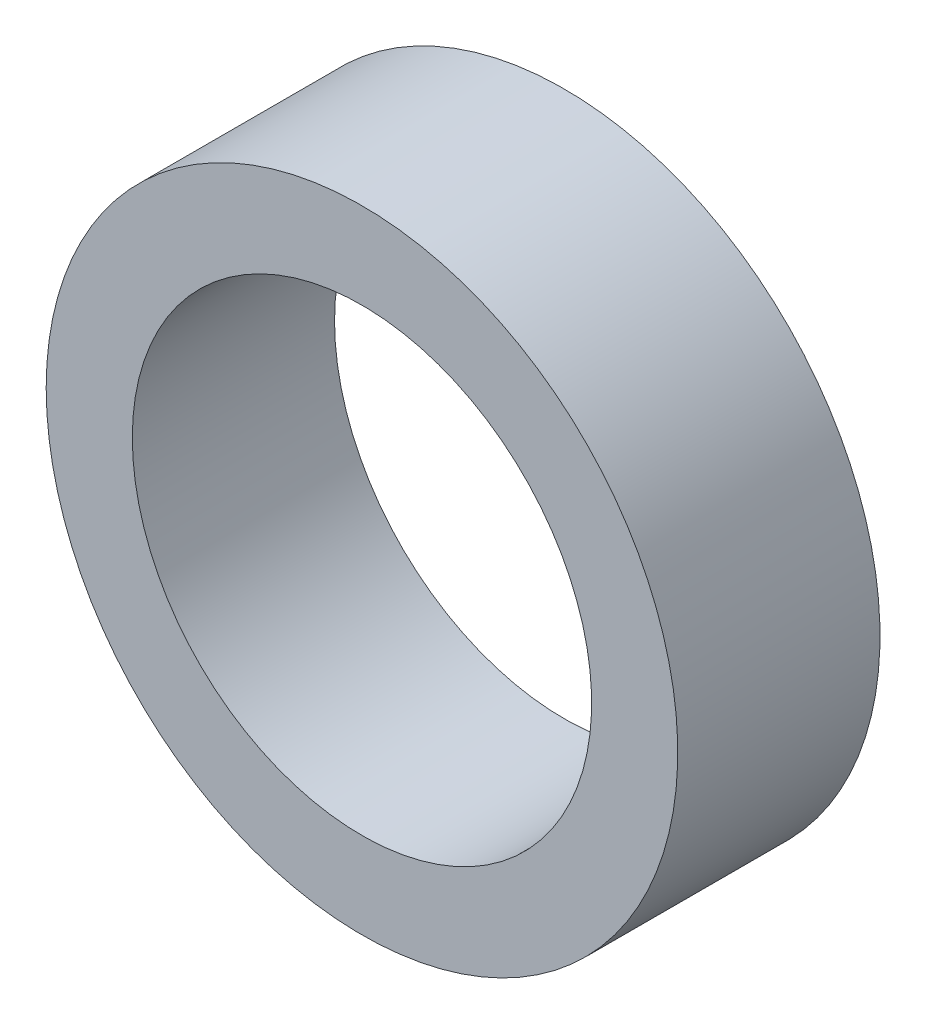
ISO-10303-21;
HEADER;
FILE_DESCRIPTION(('STEP AP214'),'2;1');
FILE_NAME('part.step','',(''),(''),'','','');
FILE_SCHEMA(('AUTOMOTIVE_DESIGN { 1 0 10303 214 1 1 1 1 }'));
ENDSEC;
DATA;
#1=APPLICATION_CONTEXT('core data for automotive mechanical design processes');
#2=APPLICATION_PROTOCOL_DEFINITION('international standard','automotive_design',2000,#1);
#3=PRODUCT_CONTEXT('',#1,'mechanical');
#4=PRODUCT('Part','Part','',(#3));
#5=PRODUCT_RELATED_PRODUCT_CATEGORY('part','',(#4));
#6=PRODUCT_DEFINITION_FORMATION('','',#4);
#7=PRODUCT_DEFINITION_CONTEXT('part definition',#1,'design');
#8=PRODUCT_DEFINITION('design','',#6,#7);
#9=PRODUCT_DEFINITION_SHAPE('','',#8);
#10=(LENGTH_UNIT() NAMED_UNIT(*) SI_UNIT(.MILLI.,.METRE.));
#11=(NAMED_UNIT(*) PLANE_ANGLE_UNIT() SI_UNIT($,.RADIAN.));
#12=(NAMED_UNIT(*) SI_UNIT($,.STERADIAN.) SOLID_ANGLE_UNIT());
#13=UNCERTAINTY_MEASURE_WITH_UNIT(LENGTH_MEASURE(1.E-05),#10,'distance_accuracy_value','');
#14=(GEOMETRIC_REPRESENTATION_CONTEXT(3) GLOBAL_UNCERTAINTY_ASSIGNED_CONTEXT((#13)) GLOBAL_UNIT_ASSIGNED_CONTEXT((#10,
#11,#12)) REPRESENTATION_CONTEXT('',''));
#15=CARTESIAN_POINT('',(0.,0.,0.));
#16=DIRECTION('',(0.,0.,1.));
#17=DIRECTION('',(1.,0.,0.));
#18=AXIS2_PLACEMENT_3D('',#15,#16,#17);
#19=CARTESIAN_POINT('',(0.,0.,6.604));
#20=DIRECTION('',(0.,0.,1.));
#21=DIRECTION('',(1.,0.,0.));
#22=AXIS2_PLACEMENT_3D('',#19,#20,#21);
#23=PLANE('',#22);
#24=CARTESIAN_POINT('',(0.,0.,6.604));
#25=DIRECTION('',(0.,0.,1.));
#26=DIRECTION('',(1.,0.,0.));
#27=AXIS2_PLACEMENT_3D('',#24,#25,#26);
#28=CIRCLE('',#27,10.3124);
#29=CARTESIAN_POINT('',(-10.3124,0.,6.604));
#30=VERTEX_POINT('',#29);
#31=EDGE_CURVE('E10',#30,#30,#28,.T.);
#32=ORIENTED_EDGE('',*,*,#31,.T.);
#33=EDGE_LOOP('',(#32));
#34=FACE_BOUND('',#33,.T.);
#35=CARTESIAN_POINT('',(0.,0.,6.604));
#36=DIRECTION('',(0.,0.,1.));
#37=DIRECTION('',(1.,0.,0.));
#38=AXIS2_PLACEMENT_3D('',#35,#36,#37);
#39=CIRCLE('',#38,7.5);
#40=CARTESIAN_POINT('',(-7.5,0.,6.604));
#41=VERTEX_POINT('',#40);
#42=EDGE_CURVE('E42',#41,#41,#39,.T.);
#43=ORIENTED_EDGE('',*,*,#42,.F.);
#44=EDGE_LOOP('',(#43));
#45=FACE_BOUND('',#44,.T.);
#46=ADVANCED_FACE('F31',(#34,#45),#23,.T.);
#47=CARTESIAN_POINT('',(0.,0.,0.));
#48=DIRECTION('',(0.,0.,1.));
#49=DIRECTION('',(1.,0.,0.));
#50=AXIS2_PLACEMENT_3D('',#47,#48,#49);
#51=PLANE('',#50);
#52=CARTESIAN_POINT('',(0.,0.,0.));
#53=DIRECTION('',(0.,0.,1.));
#54=DIRECTION('',(1.,0.,0.));
#55=AXIS2_PLACEMENT_3D('',#52,#53,#54);
#56=CIRCLE('',#55,10.3124);
#57=CARTESIAN_POINT('',(-10.3124,0.,0.));
#58=VERTEX_POINT('',#57);
#59=EDGE_CURVE('E35',#58,#58,#56,.T.);
#60=ORIENTED_EDGE('',*,*,#59,.F.);
#61=EDGE_LOOP('',(#60));
#62=FACE_BOUND('',#61,.T.);
#63=CARTESIAN_POINT('',(0.,0.,0.));
#64=DIRECTION('',(0.,0.,1.));
#65=DIRECTION('',(1.,0.,0.));
#66=AXIS2_PLACEMENT_3D('',#63,#64,#65);
#67=CIRCLE('',#66,7.5);
#68=CARTESIAN_POINT('',(-7.5,0.,0.));
#69=VERTEX_POINT('',#68);
#70=EDGE_CURVE('E44',#69,#69,#67,.T.);
#71=ORIENTED_EDGE('',*,*,#70,.T.);
#72=EDGE_LOOP('',(#71));
#73=FACE_BOUND('',#72,.T.);
#74=ADVANCED_FACE('F54',(#62,#73),#51,.F.);
#75=CARTESIAN_POINT('',(0.,0.,6.604));
#76=DIRECTION('',(0.,0.,-1.));
#77=DIRECTION('',(-1.,0.,0.));
#78=AXIS2_PLACEMENT_3D('',#75,#76,#77);
#79=CYLINDRICAL_SURFACE('',#78,10.3124);
#80=CARTESIAN_POINT('',(-10.3124,0.,6.604));
#81=CARTESIAN_POINT('',(-10.3124,0.,6.53520833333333));
#82=CARTESIAN_POINT('',(-10.3124,0.,6.46641666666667));
#83=CARTESIAN_POINT('',(-10.3124,0.,6.32883333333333));
#84=CARTESIAN_POINT('',(-10.3124,0.,6.26004166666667));
#85=CARTESIAN_POINT('',(-10.3124,0.,6.12245833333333));
#86=CARTESIAN_POINT('',(-10.3124,0.,6.05366666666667));
#87=CARTESIAN_POINT('',(-10.3124,0.,5.91608333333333));
#88=CARTESIAN_POINT('',(-10.3124,0.,5.84729166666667));
#89=CARTESIAN_POINT('',(-10.3124,0.,5.70970833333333));
#90=CARTESIAN_POINT('',(-10.3124,0.,5.64091666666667));
#91=CARTESIAN_POINT('',(-10.3124,0.,5.50333333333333));
#92=CARTESIAN_POINT('',(-10.3124,0.,5.43454166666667));
#93=CARTESIAN_POINT('',(-10.3124,0.,5.29695833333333));
#94=CARTESIAN_POINT('',(-10.3124,0.,5.22816666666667));
#95=CARTESIAN_POINT('',(-10.3124,0.,5.09058333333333));
#96=CARTESIAN_POINT('',(-10.3124,0.,5.02179166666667));
#97=CARTESIAN_POINT('',(-10.3124,0.,4.88420833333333));
#98=CARTESIAN_POINT('',(-10.3124,0.,4.81541666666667));
#99=CARTESIAN_POINT('',(-10.3124,0.,4.67783333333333));
#100=CARTESIAN_POINT('',(-10.3124,0.,4.60904166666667));
#101=CARTESIAN_POINT('',(-10.3124,0.,4.47145833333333));
#102=CARTESIAN_POINT('',(-10.3124,0.,4.40266666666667));
#103=CARTESIAN_POINT('',(-10.3124,0.,4.26508333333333));
#104=CARTESIAN_POINT('',(-10.3124,0.,4.19629166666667));
#105=CARTESIAN_POINT('',(-10.3124,0.,4.05870833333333));
#106=CARTESIAN_POINT('',(-10.3124,0.,3.98991666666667));
#107=CARTESIAN_POINT('',(-10.3124,0.,3.85233333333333));
#108=CARTESIAN_POINT('',(-10.3124,0.,3.78354166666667));
#109=CARTESIAN_POINT('',(-10.3124,0.,3.64595833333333));
#110=CARTESIAN_POINT('',(-10.3124,0.,3.57716666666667));
#111=CARTESIAN_POINT('',(-10.3124,0.,3.43958333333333));
#112=CARTESIAN_POINT('',(-10.3124,0.,3.37079166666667));
#113=CARTESIAN_POINT('',(-10.3124,0.,3.23320833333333));
#114=CARTESIAN_POINT('',(-10.3124,0.,3.16441666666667));
#115=CARTESIAN_POINT('',(-10.3124,0.,3.02683333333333));
#116=CARTESIAN_POINT('',(-10.3124,0.,2.95804166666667));
#117=CARTESIAN_POINT('',(-10.3124,0.,2.82045833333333));
#118=CARTESIAN_POINT('',(-10.3124,0.,2.75166666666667));
#119=CARTESIAN_POINT('',(-10.3124,0.,2.61408333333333));
#120=CARTESIAN_POINT('',(-10.3124,0.,2.54529166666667));
#121=CARTESIAN_POINT('',(-10.3124,0.,2.40770833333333));
#122=CARTESIAN_POINT('',(-10.3124,0.,2.33891666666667));
#123=CARTESIAN_POINT('',(-10.3124,0.,2.20133333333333));
#124=CARTESIAN_POINT('',(-10.3124,0.,2.13254166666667));
#125=CARTESIAN_POINT('',(-10.3124,0.,1.99495833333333));
#126=CARTESIAN_POINT('',(-10.3124,0.,1.92616666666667));
#127=CARTESIAN_POINT('',(-10.3124,0.,1.78858333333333));
#128=CARTESIAN_POINT('',(-10.3124,0.,1.71979166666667));
#129=CARTESIAN_POINT('',(-10.3124,0.,1.58220833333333));
#130=CARTESIAN_POINT('',(-10.3124,0.,1.51341666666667));
#131=CARTESIAN_POINT('',(-10.3124,0.,1.37583333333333));
#132=CARTESIAN_POINT('',(-10.3124,0.,1.30704166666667));
#133=CARTESIAN_POINT('',(-10.3124,0.,1.16945833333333));
#134=CARTESIAN_POINT('',(-10.3124,0.,1.10066666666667));
#135=CARTESIAN_POINT('',(-10.3124,0.,0.963083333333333));
#136=CARTESIAN_POINT('',(-10.3124,0.,0.894291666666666));
#137=CARTESIAN_POINT('',(-10.3124,0.,0.756708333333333));
#138=CARTESIAN_POINT('',(-10.3124,0.,0.687916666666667));
#139=CARTESIAN_POINT('',(-10.3124,0.,0.550333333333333));
#140=CARTESIAN_POINT('',(-10.3124,0.,0.481541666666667));
#141=CARTESIAN_POINT('',(-10.3124,0.,0.343958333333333));
#142=CARTESIAN_POINT('',(-10.3124,0.,0.275166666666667));
#143=CARTESIAN_POINT('',(-10.3124,0.,0.137583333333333));
#144=CARTESIAN_POINT('',(-10.3124,0.,0.0687916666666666));
#145=CARTESIAN_POINT('',(-10.3124,0.,0.));
#146=B_SPLINE_CURVE_WITH_KNOTS('',3,(#80,#81,#82,#83,#84,#85,#86,#87,#88,#89,#90,#91,#92,#93,
#94,#95,#96,#97,#98,#99,#100,#101,#102,#103,#104,#105,#106,#107,#108,#109,#110,#111,#112,#113,
#114,#115,#116,#117,#118,#119,#120,#121,#122,#123,#124,#125,#126,#127,#128,#129,#130,#131,#132,
#133,#134,#135,#136,#137,#138,#139,#140,#141,#142,#143,#144,#145),.UNSPECIFIED.,.F.,.F.,(4,2,2,
2,2,2,2,2,2,2,2,2,2,2,2,2,2,2,2,2,2,2,2,2,2,2,2,2,2,2,2,2,4),(0.,0.206375,0.41275,0.619125,
0.8255,1.031875,1.23825,1.444625,1.651,1.857375,2.06375,2.270125,2.4765,2.682875,2.88925,
3.095625,3.302,3.508375,3.71475,3.921125,4.1275,4.333875,4.54025,4.746625,4.953,5.159375,
5.36575,5.572125,5.7785,5.984875,6.19125,6.397625,6.604),.UNSPECIFIED.);
#147=EDGE_CURVE('BSEAM33',#30,#58,#146,.T.);
#148=ORIENTED_EDGE('',*,*,#31,.F.);
#149=ORIENTED_EDGE('',*,*,#59,.T.);
#150=ORIENTED_EDGE('',*,*,#147,.T.);
#151=ORIENTED_EDGE('',*,*,#147,.F.);
#152=EDGE_LOOP('',(#148,#150,#149,#151));
#153=FACE_BOUND('',#152,.T.);
#154=ADVANCED_FACE('F33',(#153),#79,.T.);
#155=CARTESIAN_POINT('',(0.,0.,6.604));
#156=DIRECTION('',(0.,0.,-1.));
#157=DIRECTION('',(-1.,0.,0.));
#158=AXIS2_PLACEMENT_3D('',#155,#156,#157);
#159=CYLINDRICAL_SURFACE('',#158,7.5);
#160=CARTESIAN_POINT('',(-7.5,0.,6.604));
#161=CARTESIAN_POINT('',(-7.5,0.,6.53520833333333));
#162=CARTESIAN_POINT('',(-7.5,0.,6.46641666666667));
#163=CARTESIAN_POINT('',(-7.5,0.,6.32883333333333));
#164=CARTESIAN_POINT('',(-7.5,0.,6.26004166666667));
#165=CARTESIAN_POINT('',(-7.5,0.,6.12245833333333));
#166=CARTESIAN_POINT('',(-7.5,0.,6.05366666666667));
#167=CARTESIAN_POINT('',(-7.5,0.,5.91608333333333));
#168=CARTESIAN_POINT('',(-7.5,0.,5.84729166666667));
#169=CARTESIAN_POINT('',(-7.5,0.,5.70970833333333));
#170=CARTESIAN_POINT('',(-7.5,0.,5.64091666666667));
#171=CARTESIAN_POINT('',(-7.5,0.,5.50333333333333));
#172=CARTESIAN_POINT('',(-7.5,0.,5.43454166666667));
#173=CARTESIAN_POINT('',(-7.5,0.,5.29695833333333));
#174=CARTESIAN_POINT('',(-7.5,0.,5.22816666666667));
#175=CARTESIAN_POINT('',(-7.5,0.,5.09058333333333));
#176=CARTESIAN_POINT('',(-7.5,0.,5.02179166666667));
#177=CARTESIAN_POINT('',(-7.5,0.,4.88420833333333));
#178=CARTESIAN_POINT('',(-7.5,0.,4.81541666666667));
#179=CARTESIAN_POINT('',(-7.5,0.,4.67783333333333));
#180=CARTESIAN_POINT('',(-7.5,0.,4.60904166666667));
#181=CARTESIAN_POINT('',(-7.5,0.,4.47145833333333));
#182=CARTESIAN_POINT('',(-7.5,0.,4.40266666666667));
#183=CARTESIAN_POINT('',(-7.5,0.,4.26508333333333));
#184=CARTESIAN_POINT('',(-7.5,0.,4.19629166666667));
#185=CARTESIAN_POINT('',(-7.5,0.,4.05870833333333));
#186=CARTESIAN_POINT('',(-7.5,0.,3.98991666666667));
#187=CARTESIAN_POINT('',(-7.5,0.,3.85233333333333));
#188=CARTESIAN_POINT('',(-7.5,0.,3.78354166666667));
#189=CARTESIAN_POINT('',(-7.5,0.,3.64595833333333));
#190=CARTESIAN_POINT('',(-7.5,0.,3.57716666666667));
#191=CARTESIAN_POINT('',(-7.5,0.,3.43958333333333));
#192=CARTESIAN_POINT('',(-7.5,0.,3.37079166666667));
#193=CARTESIAN_POINT('',(-7.5,0.,3.23320833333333));
#194=CARTESIAN_POINT('',(-7.5,0.,3.16441666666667));
#195=CARTESIAN_POINT('',(-7.5,0.,3.02683333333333));
#196=CARTESIAN_POINT('',(-7.5,0.,2.95804166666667));
#197=CARTESIAN_POINT('',(-7.5,0.,2.82045833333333));
#198=CARTESIAN_POINT('',(-7.5,0.,2.75166666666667));
#199=CARTESIAN_POINT('',(-7.5,0.,2.61408333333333));
#200=CARTESIAN_POINT('',(-7.5,0.,2.54529166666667));
#201=CARTESIAN_POINT('',(-7.5,0.,2.40770833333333));
#202=CARTESIAN_POINT('',(-7.5,0.,2.33891666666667));
#203=CARTESIAN_POINT('',(-7.5,0.,2.20133333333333));
#204=CARTESIAN_POINT('',(-7.5,0.,2.13254166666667));
#205=CARTESIAN_POINT('',(-7.5,0.,1.99495833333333));
#206=CARTESIAN_POINT('',(-7.5,0.,1.92616666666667));
#207=CARTESIAN_POINT('',(-7.5,0.,1.78858333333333));
#208=CARTESIAN_POINT('',(-7.5,0.,1.71979166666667));
#209=CARTESIAN_POINT('',(-7.5,0.,1.58220833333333));
#210=CARTESIAN_POINT('',(-7.5,0.,1.51341666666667));
#211=CARTESIAN_POINT('',(-7.5,0.,1.37583333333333));
#212=CARTESIAN_POINT('',(-7.5,0.,1.30704166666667));
#213=CARTESIAN_POINT('',(-7.5,0.,1.16945833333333));
#214=CARTESIAN_POINT('',(-7.5,0.,1.10066666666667));
#215=CARTESIAN_POINT('',(-7.5,0.,0.963083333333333));
#216=CARTESIAN_POINT('',(-7.5,0.,0.894291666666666));
#217=CARTESIAN_POINT('',(-7.5,0.,0.756708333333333));
#218=CARTESIAN_POINT('',(-7.5,0.,0.687916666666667));
#219=CARTESIAN_POINT('',(-7.5,0.,0.550333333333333));
#220=CARTESIAN_POINT('',(-7.5,0.,0.481541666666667));
#221=CARTESIAN_POINT('',(-7.5,0.,0.343958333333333));
#222=CARTESIAN_POINT('',(-7.5,0.,0.275166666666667));
#223=CARTESIAN_POINT('',(-7.5,0.,0.137583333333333));
#224=CARTESIAN_POINT('',(-7.5,0.,0.0687916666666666));
#225=CARTESIAN_POINT('',(-7.5,0.,0.));
#226=B_SPLINE_CURVE_WITH_KNOTS('',3,(#160,#161,#162,#163,#164,#165,#166,#167,#168,#169,#170,
#171,#172,#173,#174,#175,#176,#177,#178,#179,#180,#181,#182,#183,#184,#185,#186,#187,#188,#189,
#190,#191,#192,#193,#194,#195,#196,#197,#198,#199,#200,#201,#202,#203,#204,#205,#206,#207,#208,
#209,#210,#211,#212,#213,#214,#215,#216,#217,#218,#219,#220,#221,#222,#223,#224,#225),
.UNSPECIFIED.,.F.,.F.,(4,2,2,2,2,2,2,2,2,2,2,2,2,2,2,2,2,2,2,2,2,2,2,2,2,2,2,2,2,2,2,2,4),(0.,
0.206375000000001,0.412750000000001,0.619125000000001,0.825500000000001,1.031875,1.23825,
1.444625,1.651,1.857375,2.06375,2.270125,2.4765,2.682875,2.88925,3.095625,3.302,3.508375,
3.71475,3.921125,4.1275,4.333875,4.54025,4.746625,4.953,5.159375,5.36575,5.572125,5.7785,
5.984875,6.19125,6.397625,6.604),.UNSPECIFIED.);
#227=EDGE_CURVE('BSEAM50',#41,#69,#226,.T.);
#228=ORIENTED_EDGE('',*,*,#42,.T.);
#229=ORIENTED_EDGE('',*,*,#70,.F.);
#230=ORIENTED_EDGE('',*,*,#227,.T.);
#231=ORIENTED_EDGE('',*,*,#227,.F.);
#232=EDGE_LOOP('',(#228,#230,#229,#231));
#233=FACE_BOUND('',#232,.T.);
#234=ADVANCED_FACE('F50',(#233),#159,.F.);
#235=CLOSED_SHELL('',(#46,#74,#154,#234));
#236=MANIFOLD_SOLID_BREP('B2',#235);
#237=ADVANCED_BREP_SHAPE_REPRESENTATION('',(#18,#236),#14);
#238=SHAPE_DEFINITION_REPRESENTATION(#9,#237);
ENDSEC;
END-ISO-10303-21;
